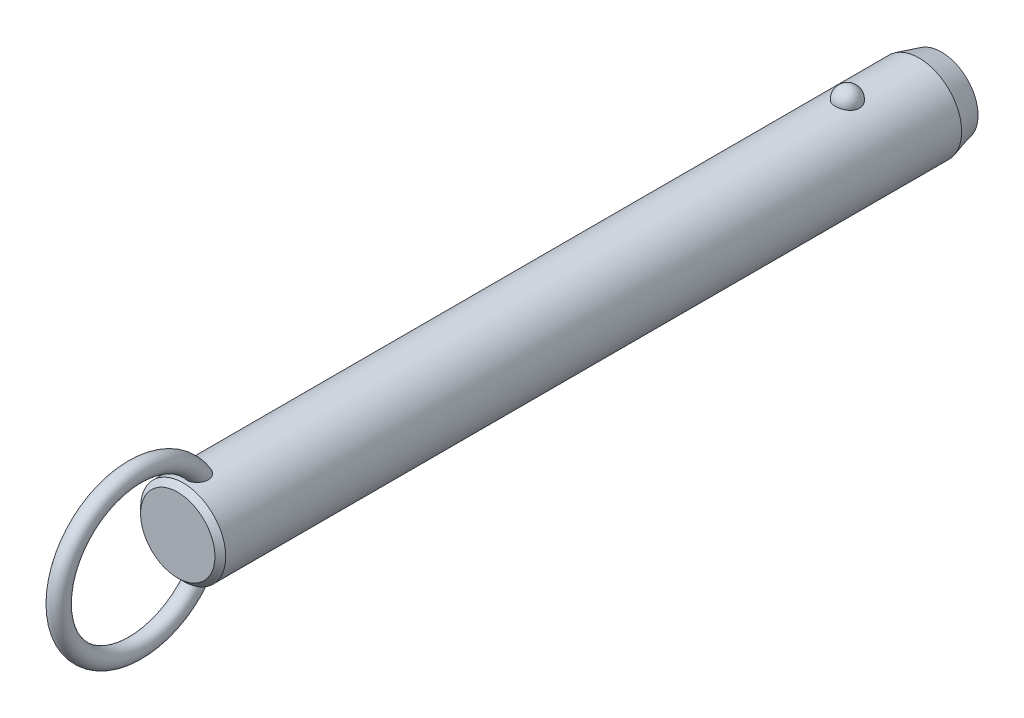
ISO-10303-21;
HEADER;
FILE_DESCRIPTION(('STEP AP214'),'2;1');
FILE_NAME('part.step','',(''),(''),'','','');
FILE_SCHEMA(('AUTOMOTIVE_DESIGN { 1 0 10303 214 1 1 1 1 }'));
ENDSEC;
DATA;
#1=APPLICATION_CONTEXT('core data for automotive mechanical design processes');
#2=APPLICATION_PROTOCOL_DEFINITION('international standard','automotive_design',2000,#1);
#3=PRODUCT_CONTEXT('',#1,'mechanical');
#4=PRODUCT('Part','Part','',(#3));
#5=PRODUCT_RELATED_PRODUCT_CATEGORY('part','',(#4));
#6=PRODUCT_DEFINITION_FORMATION('','',#4);
#7=PRODUCT_DEFINITION_CONTEXT('part definition',#1,'design');
#8=PRODUCT_DEFINITION('design','',#6,#7);
#9=PRODUCT_DEFINITION_SHAPE('','',#8);
#10=(LENGTH_UNIT() NAMED_UNIT(*) SI_UNIT(.MILLI.,.METRE.));
#11=(NAMED_UNIT(*) PLANE_ANGLE_UNIT() SI_UNIT($,.RADIAN.));
#12=(NAMED_UNIT(*) SI_UNIT($,.STERADIAN.) SOLID_ANGLE_UNIT());
#13=UNCERTAINTY_MEASURE_WITH_UNIT(LENGTH_MEASURE(1.E-05),#10,'distance_accuracy_value','');
#14=(GEOMETRIC_REPRESENTATION_CONTEXT(3) GLOBAL_UNCERTAINTY_ASSIGNED_CONTEXT((#13)) GLOBAL_UNIT_ASSIGNED_CONTEXT((#10,
#11,#12)) REPRESENTATION_CONTEXT('',''));
#15=CARTESIAN_POINT('',(0.,0.,0.));
#16=DIRECTION('',(0.,0.,1.));
#17=DIRECTION('',(1.,0.,0.));
#18=AXIS2_PLACEMENT_3D('',#15,#16,#17);
#19=CARTESIAN_POINT('',(0.,0.,137.2));
#20=DIRECTION('',(0.,0.,-1.));
#21=DIRECTION('',(-1.,0.,0.));
#22=AXIS2_PLACEMENT_3D('',#19,#20,#21);
#23=CYLINDRICAL_SURFACE('',#22,9.5);
#24=CARTESIAN_POINT('',(2.67259918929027,9.11631578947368,-2.70000000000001));
#25=CARTESIAN_POINT('',(2.6725968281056,9.11631786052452,-2.54909854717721));
#26=CARTESIAN_POINT('',(2.66030567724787,9.11994722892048,-2.39816735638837));
#27=CARTESIAN_POINT('',(2.6114347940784,9.13405924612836,-2.10058568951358));
#28=CARTESIAN_POINT('',(2.57484658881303,9.14454428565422,-1.95393672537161));
#29=CARTESIAN_POINT('',(2.47830875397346,9.17117631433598,-1.66916069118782));
#30=CARTESIAN_POINT('',(2.41836936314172,9.18732082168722,-1.53102991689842));
#31=CARTESIAN_POINT('',(2.27661331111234,9.22346780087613,-1.26705393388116));
#32=CARTESIAN_POINT('',(2.19479699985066,9.24347021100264,-1.14120852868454));
#33=CARTESIAN_POINT('',(2.01085282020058,9.28522401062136,-0.904632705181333));
#34=CARTESIAN_POINT('',(1.90862396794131,9.30698376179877,-0.793982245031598));
#35=CARTESIAN_POINT('',(1.6867437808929,9.34973971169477,-0.591607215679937));
#36=CARTESIAN_POINT('',(1.56709244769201,9.37073591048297,-0.499882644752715));
#37=CARTESIAN_POINT('',(1.31393976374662,9.40956370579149,-0.338167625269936));
#38=CARTESIAN_POINT('',(1.18048026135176,9.42740444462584,-0.268113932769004));
#39=CARTESIAN_POINT('',(0.903154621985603,9.45799906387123,-0.151390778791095));
#40=CARTESIAN_POINT('',(0.759289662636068,9.47075351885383,-0.104718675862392));
#41=CARTESIAN_POINT('',(0.468074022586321,9.48956256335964,-0.0367633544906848));
#42=CARTESIAN_POINT('',(0.320836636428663,9.49573643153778,-0.0150275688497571));
#43=CARTESIAN_POINT('',(0.0246714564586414,9.50112183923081,0.00396199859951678));
#44=CARTESIAN_POINT('',(-0.124256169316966,9.50033406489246,0.00121819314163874));
#45=CARTESIAN_POINT('',(-0.417264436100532,9.4919475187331,-0.0284441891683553));
#46=CARTESIAN_POINT('',(-0.56138413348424,9.48444885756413,-0.0550074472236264));
#47=CARTESIAN_POINT('',(-0.842986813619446,9.46357853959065,-0.131064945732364));
#48=CARTESIAN_POINT('',(-0.980469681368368,9.450206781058,-0.180559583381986));
#49=CARTESIAN_POINT('',(-1.24585005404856,9.41890822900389,-0.301476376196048));
#50=CARTESIAN_POINT('',(-1.37368611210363,9.40095498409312,-0.373026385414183));
#51=CARTESIAN_POINT('',(-1.61552738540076,9.3624296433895,-0.536025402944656));
#52=CARTESIAN_POINT('',(-1.72953116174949,9.34185727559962,-0.627476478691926));
#53=CARTESIAN_POINT('',(-1.9429225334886,9.29984568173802,-0.829844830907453));
#54=CARTESIAN_POINT('',(-2.04198021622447,9.27839736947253,-0.941108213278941));
#55=CARTESIAN_POINT('',(-2.2202646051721,9.23735994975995,-1.17883414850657));
#56=CARTESIAN_POINT('',(-2.29948985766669,9.21777097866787,-1.30529781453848));
#57=CARTESIAN_POINT('',(-2.43697287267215,9.18238994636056,-1.57158566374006));
#58=CARTESIAN_POINT('',(-2.49497068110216,9.16664569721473,-1.71155057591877));
#59=CARTESIAN_POINT('',(-2.5872073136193,9.14104303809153,-1.99961197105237));
#60=CARTESIAN_POINT('',(-2.62144683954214,9.13118445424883,-2.14770821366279));
#61=CARTESIAN_POINT('',(-2.66521466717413,9.11850622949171,-2.44715424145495));
#62=CARTESIAN_POINT('',(-2.67484831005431,9.11565658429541,-2.59848735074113));
#63=CARTESIAN_POINT('',(-2.66946735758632,9.11723375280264,-2.90067317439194));
#64=CARTESIAN_POINT('',(-2.65445345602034,9.12166036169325,-3.05152590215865));
#65=CARTESIAN_POINT('',(-2.6002971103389,9.13724422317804,-3.34766110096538));
#66=CARTESIAN_POINT('',(-2.56127978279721,9.14836656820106,-3.49296833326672));
#67=CARTESIAN_POINT('',(-2.46018844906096,9.17606676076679,-3.77477535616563));
#68=CARTESIAN_POINT('',(-2.39811349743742,9.19264483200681,-3.9112747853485));
#69=CARTESIAN_POINT('',(-2.25202303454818,9.22952198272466,-4.17244273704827));
#70=CARTESIAN_POINT('',(-2.16788714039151,9.24984129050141,-4.29704106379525));
#71=CARTESIAN_POINT('',(-1.9799408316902,9.29188255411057,-4.53013066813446));
#72=CARTESIAN_POINT('',(-1.87612963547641,9.31360456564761,-4.63862130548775));
#73=CARTESIAN_POINT('',(-1.65105429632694,9.35612959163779,-4.8369029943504));
#74=CARTESIAN_POINT('',(-1.52972405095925,9.37692871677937,-4.92661991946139));
#75=CARTESIAN_POINT('',(-1.27318250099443,9.41518970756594,-5.08429106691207));
#76=CARTESIAN_POINT('',(-1.13797219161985,9.432651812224,-5.15224684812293));
#77=CARTESIAN_POINT('',(-0.859280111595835,9.46208255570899,-5.26371827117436));
#78=CARTESIAN_POINT('',(-0.715925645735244,9.47411833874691,-5.30753421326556));
#79=CARTESIAN_POINT('',(-0.423550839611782,9.4916822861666,-5.37076321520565));
#80=CARTESIAN_POINT('',(-0.2745312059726,9.49721125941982,-5.39017930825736));
#81=CARTESIAN_POINT('',(0.0218446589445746,9.50110860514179,-5.40390587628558));
#82=CARTESIAN_POINT('',(0.16917707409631,9.49961381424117,-5.39869609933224));
#83=CARTESIAN_POINT('',(0.460808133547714,9.48993906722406,-5.36441955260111));
#84=CARTESIAN_POINT('',(0.605106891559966,9.48175936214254,-5.33535367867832));
#85=CARTESIAN_POINT('',(0.886027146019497,9.4596376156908,-5.25435587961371));
#86=CARTESIAN_POINT('',(1.02267710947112,9.44571881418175,-5.20251612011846));
#87=CARTESIAN_POINT('',(1.28523827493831,9.41358993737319,-5.07741549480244));
#88=CARTESIAN_POINT('',(1.41114877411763,9.39537958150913,-5.00415322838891));
#89=CARTESIAN_POINT('',(1.65085227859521,9.3562644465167,-4.83684599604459));
#90=CARTESIAN_POINT('',(1.76442346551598,9.33532178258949,-4.74249218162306));
#91=CARTESIAN_POINT('',(1.97425672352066,9.29321198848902,-4.53620389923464));
#92=CARTESIAN_POINT('',(2.07051582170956,9.27204482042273,-4.42426641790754));
#93=CARTESIAN_POINT('',(2.24490086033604,9.23139221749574,-4.18363183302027));
#94=CARTESIAN_POINT('',(2.32267019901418,9.21194380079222,-4.05466990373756));
#95=CARTESIAN_POINT('',(2.45584092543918,9.1773419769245,-3.78517836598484));
#96=CARTESIAN_POINT('',(2.51124979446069,9.16218713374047,-3.64465264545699));
#97=CARTESIAN_POINT('',(2.59380876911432,9.13913522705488,-3.37104301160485));
#98=CARTESIAN_POINT('',(2.62330266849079,9.13064624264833,-3.23871053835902));
#99=CARTESIAN_POINT('',(2.66269870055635,9.11923566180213,-2.97092664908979));
#100=CARTESIAN_POINT('',(2.67260130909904,9.11631393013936,-2.83547530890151));
#101=CARTESIAN_POINT('',(2.67259918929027,9.11631578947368,-2.70000000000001));
#102=B_SPLINE_CURVE_WITH_KNOTS('',3,(#24,#25,#26,#27,#28,#29,#30,#31,#32,#33,#34,#35,#36,#37,
#38,#39,#40,#41,#42,#43,#44,#45,#46,#47,#48,#49,#50,#51,#52,#53,#54,#55,#56,#57,#58,#59,#60,#61,
#62,#63,#64,#65,#66,#67,#68,#69,#70,#71,#72,#73,#74,#75,#76,#77,#78,#79,#80,#81,#82,#83,#84,#85,
#86,#87,#88,#89,#90,#91,#92,#93,#94,#95,#96,#97,#98,#99,#100,#101),.UNSPECIFIED.,.T.,.F.,(4,2,2,
2,2,2,2,2,2,2,2,2,2,2,2,2,2,2,2,2,2,2,2,2,2,2,2,2,2,2,2,2,2,2,2,2,2,2,4),(0.,0.452217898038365,
0.904593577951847,1.35677112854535,1.80894144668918,2.26340676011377,2.71787203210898,
3.17099820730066,3.62407318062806,4.0687883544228,4.51345969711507,4.95160616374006,
5.38976021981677,5.83050358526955,6.27129275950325,6.72071308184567,7.17016633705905,
7.62495278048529,8.07972578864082,8.53254856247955,8.98535859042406,9.43582813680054,
9.88631615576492,10.3393155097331,10.7923328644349,11.2471065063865,11.7018475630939,
12.150795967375,12.5996885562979,13.0398725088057,13.4800399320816,13.9184421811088,
14.3568730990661,14.802202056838,15.2476074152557,15.7010097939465,16.1542603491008,
16.5602594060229,16.9662486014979),.UNSPECIFIED.);
#103=CARTESIAN_POINT('',(2.67259918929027,9.11631578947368,-2.70000000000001));
#104=VERTEX_POINT('',#103);
#105=EDGE_CURVE('E41',#104,#104,#102,.T.);
#106=ORIENTED_EDGE('',*,*,#105,.T.);
#107=EDGE_LOOP('',(#106));
#108=FACE_BOUND('',#107,.T.);
#109=CARTESIAN_POINT('',(0.,0.,145.52));
#110=DIRECTION('',(0.,0.,1.));
#111=DIRECTION('',(1.,0.,0.));
#112=AXIS2_PLACEMENT_3D('',#109,#110,#111);
#113=CIRCLE('',#112,9.5);
#114=CARTESIAN_POINT('',(9.5,0.,145.52));
#115=VERTEX_POINT('',#114);
#116=EDGE_CURVE('E10',#115,#115,#113,.F.);
#117=ORIENTED_EDGE('',*,*,#116,.T.);
#118=EDGE_LOOP('',(#117));
#119=FACE_BOUND('',#118,.T.);
#120=CARTESIAN_POINT('',(-0.697062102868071,-9.47439269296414,139.867808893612));
#121=CARTESIAN_POINT('',(-0.799579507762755,-9.46685146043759,139.907482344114));
#122=CARTESIAN_POINT('',(-0.898575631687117,-9.45788043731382,139.9559309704));
#123=CARTESIAN_POINT('',(-1.08670047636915,-9.43811593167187,140.068868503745));
#124=CARTESIAN_POINT('',(-1.17583204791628,-9.42732297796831,140.133352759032));
#125=CARTESIAN_POINT('',(-1.34179806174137,-9.40513672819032,140.276209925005));
#126=CARTESIAN_POINT('',(-1.41865133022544,-9.39374438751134,140.354561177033));
#127=CARTESIAN_POINT('',(-1.55860047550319,-9.37154196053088,140.522752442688));
#128=CARTESIAN_POINT('',(-1.62169476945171,-9.3607319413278,140.61259377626));
#129=CARTESIAN_POINT('',(-1.73527695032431,-9.34035749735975,140.804500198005));
#130=CARTESIAN_POINT('',(-1.78522266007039,-9.33085270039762,140.906891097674));
#131=CARTESIAN_POINT('',(-1.86924997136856,-9.3143834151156,141.118148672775));
#132=CARTESIAN_POINT('',(-1.90332570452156,-9.30741986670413,141.227017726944));
#133=CARTESIAN_POINT('',(-1.95893603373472,-9.29588482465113,141.460473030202));
#134=CARTESIAN_POINT('',(-1.97872420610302,-9.29165182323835,141.585489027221));
#135=CARTESIAN_POINT('',(-2.00062129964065,-9.28695978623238,141.837080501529));
#136=CARTESIAN_POINT('',(-2.00272284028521,-9.28650232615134,141.963656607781));
#137=CARTESIAN_POINT('',(-1.98958876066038,-9.28932750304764,142.236815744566));
#138=CARTESIAN_POINT('',(-1.97143366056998,-9.2932400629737,142.383251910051));
#139=CARTESIAN_POINT('',(-1.91479925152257,-9.30507151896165,142.672062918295));
#140=CARTESIAN_POINT('',(-1.87629122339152,-9.31299607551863,142.814431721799));
#141=CARTESIAN_POINT('',(-1.77225683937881,-9.33340232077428,143.115172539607));
#142=CARTESIAN_POINT('',(-1.70334898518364,-9.34641636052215,143.272369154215));
#143=CARTESIAN_POINT('',(-1.58111062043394,-9.36759153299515,143.497517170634));
#144=CARTESIAN_POINT('',(-1.53721459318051,-9.37492619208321,143.570796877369));
#145=CARTESIAN_POINT('',(-1.4430263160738,-9.38988566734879,143.71307405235));
#146=CARTESIAN_POINT('',(-1.39273721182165,-9.39751033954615,143.782073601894));
#147=CARTESIAN_POINT('',(-1.26775962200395,-9.41530678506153,143.936983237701));
#148=CARTESIAN_POINT('',(-1.19052326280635,-9.42548108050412,144.020871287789));
#149=CARTESIAN_POINT('',(-1.02420241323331,-9.44499825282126,144.176008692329));
#150=CARTESIAN_POINT('',(-0.93513986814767,-9.45434261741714,144.247280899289));
#151=CARTESIAN_POINT('',(-0.766610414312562,-9.46930670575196,144.358695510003));
#152=CARTESIAN_POINT('',(-0.689439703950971,-9.47529223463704,144.402235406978));
#153=CARTESIAN_POINT('',(-0.528942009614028,-9.48560294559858,144.47631336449));
#154=CARTESIAN_POINT('',(-0.445620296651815,-9.48992953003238,144.506862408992));
#155=CARTESIAN_POINT('',(-0.273901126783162,-9.49644161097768,144.552579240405));
#156=CARTESIAN_POINT('',(-0.18546574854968,-9.49860811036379,144.56761059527));
#157=CARTESIAN_POINT('',(-0.00734541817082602,-9.5004135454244,144.580149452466));
#158=CARTESIAN_POINT('',(0.0823387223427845,-9.50005405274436,144.577667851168));
#159=CARTESIAN_POINT('',(0.24767927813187,-9.49708301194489,144.556995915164));
#160=CARTESIAN_POINT('',(0.323620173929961,-9.49477609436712,144.540930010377));
#161=CARTESIAN_POINT('',(0.471981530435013,-9.48855917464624,144.497172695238));
#162=CARTESIAN_POINT('',(0.544400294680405,-9.48464840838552,144.469475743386));
#163=CARTESIAN_POINT('',(0.708947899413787,-9.47398336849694,144.39280266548));
#164=CARTESIAN_POINT('',(0.799149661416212,-9.46671310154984,144.339774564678));
#165=CARTESIAN_POINT('',(0.969783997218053,-9.45076225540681,144.219973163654));
#166=CARTESIAN_POINT('',(1.050194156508,-9.44207854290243,144.153169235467));
#167=CARTESIAN_POINT('',(1.23092343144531,-9.42051459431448,143.980759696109));
#168=CARTESIAN_POINT('',(1.32652499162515,-9.40733378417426,143.87026193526));
#169=CARTESIAN_POINT('',(1.49893121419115,-9.38140745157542,143.635561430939));
#170=CARTESIAN_POINT('',(1.5757161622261,-9.36866239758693,143.511344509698));
#171=CARTESIAN_POINT('',(1.71285426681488,-9.34457644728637,143.249389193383));
#172=CARTESIAN_POINT('',(1.77266365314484,-9.33328726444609,143.11136233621));
#173=CARTESIAN_POINT('',(1.87239208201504,-9.31379209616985,142.828051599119));
#174=CARTESIAN_POINT('',(1.91230158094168,-9.3055875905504,142.682764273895));
#175=CARTESIAN_POINT('',(1.97604189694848,-9.29228394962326,142.362028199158));
#176=CARTESIAN_POINT('',(1.9958743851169,-9.28797202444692,142.185724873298));
#177=CARTESIAN_POINT('',(2.0029570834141,-9.28645519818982,141.832414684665));
#178=CARTESIAN_POINT('',(1.99025930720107,-9.28923895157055,141.655409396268));
#179=CARTESIAN_POINT('',(1.93735479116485,-9.30038134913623,141.356338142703));
#180=CARTESIAN_POINT('',(1.90576827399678,-9.30697680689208,141.232667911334));
#181=CARTESIAN_POINT('',(1.8228748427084,-9.32356855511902,140.992329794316));
#182=CARTESIAN_POINT('',(1.77158213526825,-9.33356239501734,140.875656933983));
#183=CARTESIAN_POINT('',(1.64885744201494,-9.35602275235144,140.652706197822));
#184=CARTESIAN_POINT('',(1.57730995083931,-9.36850332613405,140.546492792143));
#185=CARTESIAN_POINT('',(1.41543264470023,-9.39431873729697,140.349553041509));
#186=CARTESIAN_POINT('',(1.32510883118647,-9.40765330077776,140.258821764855));
#187=CARTESIAN_POINT('',(1.13846223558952,-9.43195720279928,140.105033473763));
#188=CARTESIAN_POINT('',(1.04369890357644,-9.44302894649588,140.040094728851));
#189=CARTESIAN_POINT('',(0.843965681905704,-9.46296805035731,139.928038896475));
#190=CARTESIAN_POINT('',(0.739000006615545,-9.47183631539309,139.880914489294));
#191=CARTESIAN_POINT('',(0.528175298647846,-9.48586140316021,139.808117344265));
#192=CARTESIAN_POINT('',(0.422686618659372,-9.49119633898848,139.78140249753));
#193=CARTESIAN_POINT('',(0.208590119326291,-9.49831365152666,139.746013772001));
#194=CARTESIAN_POINT('',(0.0999817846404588,-9.500095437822,139.737342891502));
#195=CARTESIAN_POINT('',(-0.126104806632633,-9.49988861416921,139.738350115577));
#196=CARTESIAN_POINT('',(-0.243578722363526,-9.49757821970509,139.749594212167));
#197=CARTESIAN_POINT('',(-0.474390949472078,-9.48885165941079,139.793167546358));
#198=CARTESIAN_POINT('',(-0.587729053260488,-9.48243528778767,139.825497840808));
#199=CARTESIAN_POINT('',(-0.697062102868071,-9.47439269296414,139.867808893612));
#200=B_SPLINE_CURVE_WITH_KNOTS('',3,(#120,#121,#122,#123,#124,#125,#126,#127,#128,#129,#130,
#131,#132,#133,#134,#135,#136,#137,#138,#139,#140,#141,#142,#143,#144,#145,#146,#147,#148,#149,
#150,#151,#152,#153,#154,#155,#156,#157,#158,#159,#160,#161,#162,#163,#164,#165,#166,#167,#168,
#169,#170,#171,#172,#173,#174,#175,#176,#177,#178,#179,#180,#181,#182,#183,#184,#185,#186,#187,
#188,#189,#190,#191,#192,#193,#194,#195,#196,#197,#198,#199),.UNSPECIFIED.,.T.,.F.,(4,2,2,2,2,2,
2,2,2,2,2,2,2,2,2,2,2,2,2,2,2,2,2,2,2,2,2,2,2,2,2,2,2,2,2,2,2,2,2,4),(0.,0.330119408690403,
0.660143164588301,0.989655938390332,1.31920659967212,1.66074728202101,2.00241415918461,
2.38088696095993,2.75951768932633,3.20065679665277,3.64242004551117,4.15620996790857,
4.4131416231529,4.66994734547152,5.01228664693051,5.35399933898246,5.61943037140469,
5.88463652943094,6.15215502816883,6.4195070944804,6.65144391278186,6.88349136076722,
7.19641200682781,7.51003602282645,7.94779711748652,8.3860149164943,8.83699707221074,
9.28819530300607,9.81778662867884,10.34653170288,10.7284172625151,11.1100280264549,
11.4938603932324,11.8775702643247,12.2220189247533,12.5663259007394,12.8915939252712,
13.2169159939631,13.5689650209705,13.9210316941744),.UNSPECIFIED.);
#201=CARTESIAN_POINT('',(-0.697062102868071,-9.47439269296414,139.867808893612));
#202=VERTEX_POINT('',#201);
#203=EDGE_CURVE('E59',#202,#202,#200,.T.);
#204=ORIENTED_EDGE('',*,*,#203,.T.);
#205=EDGE_LOOP('',(#204));
#206=FACE_BOUND('',#205,.T.);
#207=CARTESIAN_POINT('',(-0.697062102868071,9.47439269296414,139.867808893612));
#208=CARTESIAN_POINT('',(-0.597792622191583,9.48169483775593,139.829395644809));
#209=CARTESIAN_POINT('',(-0.495106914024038,9.48766580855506,139.799168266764));
#210=CARTESIAN_POINT('',(-0.285876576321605,9.49627648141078,139.756032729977));
#211=CARTESIAN_POINT('',(-0.179324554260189,9.49890941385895,139.743159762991));
#212=CARTESIAN_POINT('',(0.0344157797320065,9.50053798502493,139.735166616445));
#213=CARTESIAN_POINT('',(0.141603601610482,9.49953613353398,139.740034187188));
#214=CARTESIAN_POINT('',(0.35356357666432,9.49401038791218,139.767365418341));
#215=CARTESIAN_POINT('',(0.458336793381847,9.48948807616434,139.78982117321));
#216=CARTESIAN_POINT('',(0.662493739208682,9.4774236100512,139.851671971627));
#217=CARTESIAN_POINT('',(0.761881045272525,9.46988348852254,139.891055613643));
#218=CARTESIAN_POINT('',(0.952608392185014,9.45260382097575,139.985634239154));
#219=CARTESIAN_POINT('',(1.04394806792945,9.44286417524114,140.040829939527));
#220=CARTESIAN_POINT('',(1.21712767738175,9.42211760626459,140.166066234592));
#221=CARTESIAN_POINT('',(1.29885671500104,9.41109835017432,140.236257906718));
#222=CARTESIAN_POINT('',(1.44978975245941,9.38903310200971,140.388980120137));
#223=CARTESIAN_POINT('',(1.51899278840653,9.37798710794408,140.471511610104));
#224=CARTESIAN_POINT('',(1.64602857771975,9.35654375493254,140.649776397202));
#225=CARTESIAN_POINT('',(1.70333052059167,9.34618688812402,140.745891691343));
#226=CARTESIAN_POINT('',(1.80259341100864,9.32755128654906,140.945897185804));
#227=CARTESIAN_POINT('',(1.84454942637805,9.31927322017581,141.049789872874));
#228=CARTESIAN_POINT('',(1.91637039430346,9.30478365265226,141.272213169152));
#229=CARTESIAN_POINT('',(1.944805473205,9.29882552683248,141.391219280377));
#230=CARTESIAN_POINT('',(1.98449865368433,9.29043398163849,141.632143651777));
#231=CARTESIAN_POINT('',(1.99574908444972,9.28800213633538,141.754063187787));
#232=CARTESIAN_POINT('',(2.00275141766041,9.28649645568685,142.016932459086));
#233=CARTESIAN_POINT('',(1.99588238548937,9.28799035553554,142.157952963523));
#234=CARTESIAN_POINT('',(1.96270559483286,9.29505517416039,142.437621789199));
#235=CARTESIAN_POINT('',(1.93637872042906,9.30063010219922,142.576267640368));
#236=CARTESIAN_POINT('',(1.85949176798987,9.31633564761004,142.872561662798));
#237=CARTESIAN_POINT('',(1.80549792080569,9.3270926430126,143.029290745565));
#238=CARTESIAN_POINT('',(1.67376869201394,9.3516306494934,143.332284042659));
#239=CARTESIAN_POINT('',(1.59603181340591,9.36541185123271,143.478547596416));
#240=CARTESIAN_POINT('',(1.4360277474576,9.39110706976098,143.725813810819));
#241=CARTESIAN_POINT('',(1.35831795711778,9.40278656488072,143.829791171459));
#242=CARTESIAN_POINT('',(1.18774483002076,9.42585025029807,144.024534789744));
#243=CARTESIAN_POINT('',(1.09490932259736,9.43723493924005,144.115324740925));
#244=CARTESIAN_POINT('',(0.92111037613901,9.45552616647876,144.25620334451));
#245=CARTESIAN_POINT('',(0.84373824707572,9.46281058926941,144.310656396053));
#246=CARTESIAN_POINT('',(0.681245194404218,9.47589120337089,144.406711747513));
#247=CARTESIAN_POINT('',(0.596135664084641,9.48168953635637,144.448332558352));
#248=CARTESIAN_POINT('',(0.433779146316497,9.49038144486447,144.510089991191));
#249=CARTESIAN_POINT('',(0.357459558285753,9.49359170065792,144.53260136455));
#250=CARTESIAN_POINT('',(0.202074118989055,9.49816761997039,144.564574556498));
#251=CARTESIAN_POINT('',(0.123010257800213,9.49953459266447,144.574045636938));
#252=CARTESIAN_POINT('',(-0.0357372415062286,9.50026497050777,144.579114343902));
#253=CARTESIAN_POINT('',(-0.115421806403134,9.49962433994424,144.574684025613));
#254=CARTESIAN_POINT('',(-0.272823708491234,9.49640854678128,144.552296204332));
#255=CARTESIAN_POINT('',(-0.350540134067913,9.4938325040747,144.534332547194));
#256=CARTESIAN_POINT('',(-0.500580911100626,9.48709462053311,144.486802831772));
#257=CARTESIAN_POINT('',(-0.572979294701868,9.48296359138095,144.457461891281));
#258=CARTESIAN_POINT('',(-0.712864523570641,9.47347609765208,144.389008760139));
#259=CARTESIAN_POINT('',(-0.780349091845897,9.46811906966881,144.349892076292));
#260=CARTESIAN_POINT('',(-0.946309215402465,9.45329720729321,144.239432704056));
#261=CARTESIAN_POINT('',(-1.04090230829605,9.44321512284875,144.162329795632));
#262=CARTESIAN_POINT('',(-1.21661929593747,9.42219227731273,143.99409718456));
#263=CARTESIAN_POINT('',(-1.29770519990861,9.41124921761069,143.902929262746));
#264=CARTESIAN_POINT('',(-1.47319646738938,9.38563439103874,143.676162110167));
#265=CARTESIAN_POINT('',(-1.56208878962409,9.37102009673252,143.536289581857));
#266=CARTESIAN_POINT('',(-1.71623987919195,9.34401559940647,143.243950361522));
#267=CARTESIAN_POINT('',(-1.78147866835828,9.33162728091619,143.091473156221));
#268=CARTESIAN_POINT('',(-1.88853837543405,9.31055541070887,142.775647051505));
#269=CARTESIAN_POINT('',(-1.92998995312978,9.30193076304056,142.612168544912));
#270=CARTESIAN_POINT('',(-1.98590726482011,9.29015757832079,142.280526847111));
#271=CARTESIAN_POINT('',(-2.0004070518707,9.2870021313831,142.112369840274));
#272=CARTESIAN_POINT('',(-1.99964701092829,9.28716218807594,141.805080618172));
#273=CARTESIAN_POINT('',(-1.98908145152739,9.28945704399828,141.665936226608));
#274=CARTESIAN_POINT('',(-1.94566294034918,9.29865169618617,141.391153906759));
#275=CARTESIAN_POINT('',(-1.9128206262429,9.30554929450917,141.255514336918));
#276=CARTESIAN_POINT('',(-1.84582133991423,9.31898248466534,141.057802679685));
#277=CARTESIAN_POINT('',(-1.82038084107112,9.32400364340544,140.992583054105));
#278=CARTESIAN_POINT('',(-1.76350511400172,9.33492884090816,140.864903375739));
#279=CARTESIAN_POINT('',(-1.73207305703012,9.34083241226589,140.802441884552));
#280=CARTESIAN_POINT('',(-1.66324243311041,9.35333332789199,140.68094078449));
#281=CARTESIAN_POINT('',(-1.62584239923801,9.35993084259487,140.621902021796));
#282=CARTESIAN_POINT('',(-1.54527678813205,9.37356864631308,140.507987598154));
#283=CARTESIAN_POINT('',(-1.50211241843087,9.38060884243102,140.453111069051));
#284=CARTESIAN_POINT('',(-1.37681147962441,9.40004442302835,140.309961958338));
#285=CARTESIAN_POINT('',(-1.28916358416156,9.41261047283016,140.226429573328));
#286=CARTESIAN_POINT('',(-1.09996826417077,9.43658180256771,140.077236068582));
#287=CARTESIAN_POINT('',(-0.998461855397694,9.44799034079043,140.011523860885));
#288=CARTESIAN_POINT('',(-0.860188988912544,9.46103017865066,139.9394367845));
#289=CARTESIAN_POINT('',(-0.828141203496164,9.46389141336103,139.923851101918));
#290=CARTESIAN_POINT('',(-0.763210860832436,9.46934915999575,139.894473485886));
#291=CARTESIAN_POINT('',(-0.730328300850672,9.47194567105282,139.880681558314));
#292=CARTESIAN_POINT('',(-0.697062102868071,9.47439269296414,139.867808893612));
#293=B_SPLINE_CURVE_WITH_KNOTS('',3,(#207,#208,#209,#210,#211,#212,#213,#214,#215,#216,#217,
#218,#219,#220,#221,#222,#223,#224,#225,#226,#227,#228,#229,#230,#231,#232,#233,#234,#235,#236,
#237,#238,#239,#240,#241,#242,#243,#244,#245,#246,#247,#248,#249,#250,#251,#252,#253,#254,#255,
#256,#257,#258,#259,#260,#261,#262,#263,#264,#265,#266,#267,#268,#269,#270,#271,#272,#273,#274,
#275,#276,#277,#278,#279,#280,#281,#282,#283,#284,#285,#286,#287,#288,#289,#290,#291,#292),
.UNSPECIFIED.,.T.,.F.,(4,2,2,2,2,2,2,2,2,2,2,2,2,2,2,2,2,2,2,2,2,2,2,2,2,2,2,2,2,2,2,2,2,2,2,2,
2,2,2,2,2,2,4),(0.,0.319942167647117,0.640532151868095,0.96090081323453,1.2811255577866,
1.60113495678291,1.92115886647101,2.24457323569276,2.56801248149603,2.90371927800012,
3.23953387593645,3.60560313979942,3.97183576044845,4.39383693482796,4.8162532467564,
5.31257045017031,5.80891895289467,6.19868344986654,6.58773876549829,6.87145417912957,
7.15475838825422,7.39263751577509,7.63034760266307,7.86853584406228,8.10683246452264,
8.3406366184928,8.57454843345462,8.93983939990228,9.30614105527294,9.80266668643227,
10.2996107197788,10.8040753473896,11.3079021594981,11.7249776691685,12.1418541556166,
12.3521485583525,12.5623319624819,12.7725671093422,12.9827582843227,13.345827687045,
13.7078449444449,13.8150604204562,13.9222762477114),.UNSPECIFIED.);
#294=CARTESIAN_POINT('',(-0.697062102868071,9.47439269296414,139.867808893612));
#295=VERTEX_POINT('',#294);
#296=EDGE_CURVE('E67',#295,#295,#293,.T.);
#297=ORIENTED_EDGE('',*,*,#296,.T.);
#298=EDGE_LOOP('',(#297));
#299=FACE_BOUND('',#298,.T.);
#300=CARTESIAN_POINT('',(0.,0.,-18.6999999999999));
#301=DIRECTION('',(0.,0.,-1.));
#302=DIRECTION('',(-1.,0.,0.));
#303=AXIS2_PLACEMENT_3D('',#300,#301,#302);
#304=CIRCLE('',#303,9.5);
#305=CARTESIAN_POINT('',(-9.5,0.,-18.6999999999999));
#306=VERTEX_POINT('',#305);
#307=EDGE_CURVE('E56',#306,#306,#304,.F.);
#308=ORIENTED_EDGE('',*,*,#307,.T.);
#309=EDGE_LOOP('',(#308));
#310=FACE_BOUND('',#309,.T.);
#311=ADVANCED_FACE('F37',(#108,#119,#206,#299,#310),#23,.T.);
#312=CARTESIAN_POINT('',(0.,0.,-23.7));
#313=DIRECTION('',(0.,0.,-1.));
#314=DIRECTION('',(-1.,0.,0.));
#315=AXIS2_PLACEMENT_3D('',#312,#313,#314);
#316=PLANE('',#315);
#317=CARTESIAN_POINT('',(0.,0.,-23.7));
#318=DIRECTION('',(0.,0.,-1.));
#319=DIRECTION('',(-1.,0.,0.));
#320=AXIS2_PLACEMENT_3D('',#317,#318,#319);
#321=CIRCLE('',#320,8.16025403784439);
#322=CARTESIAN_POINT('',(-8.16025403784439,0.,-23.7));
#323=VERTEX_POINT('',#322);
#324=EDGE_CURVE('E66',#323,#323,#321,.T.);
#325=ORIENTED_EDGE('',*,*,#324,.T.);
#326=EDGE_LOOP('',(#325));
#327=FACE_BOUND('',#326,.T.);
#328=ADVANCED_FACE('F85',(#327),#316,.T.);
#329=CARTESIAN_POINT('',(0.,0.,-23.7));
#330=DIRECTION('',(0.,0.,1.));
#331=DIRECTION('',(1.,0.,0.));
#332=AXIS2_PLACEMENT_3D('',#329,#330,#331);
#333=CONICAL_SURFACE('',#332,8.16025403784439,0.261799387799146);
#334=ORIENTED_EDGE('',*,*,#307,.F.);
#335=EDGE_LOOP('',(#334));
#336=FACE_BOUND('',#335,.T.);
#337=ORIENTED_EDGE('',*,*,#324,.F.);
#338=EDGE_LOOP('',(#337));
#339=FACE_BOUND('',#338,.T.);
#340=ADVANCED_FACE('F83',(#336,#339),#333,.T.);
#341=CARTESIAN_POINT('',(0.,0.,146.72));
#342=DIRECTION('',(0.,0.,1.));
#343=DIRECTION('',(1.,0.,0.));
#344=AXIS2_PLACEMENT_3D('',#341,#342,#343);
#345=PLANE('',#344);
#346=CARTESIAN_POINT('',(0.,0.,146.72));
#347=DIRECTION('',(0.,0.,1.));
#348=DIRECTION('',(1.,0.,0.));
#349=AXIS2_PLACEMENT_3D('',#346,#347,#348);
#350=CIRCLE('',#349,8.30000000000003);
#351=CARTESIAN_POINT('',(8.30000000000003,0.,146.72));
#352=VERTEX_POINT('',#351);
#353=EDGE_CURVE('E50',#352,#352,#350,.T.);
#354=ORIENTED_EDGE('',*,*,#353,.T.);
#355=EDGE_LOOP('',(#354));
#356=FACE_BOUND('',#355,.T.);
#357=ADVANCED_FACE('F77',(#356),#345,.T.);
#358=CARTESIAN_POINT('',(0.,0.,156.25));
#359=DIRECTION('',(1.,0.,0.));
#360=DIRECTION('',(0.,0.,-1.));
#361=AXIS2_PLACEMENT_3D('',#358,#359,#360);
#362=TOROIDAL_SURFACE('',#361,17.05,2.);
#363=ORIENTED_EDGE('',*,*,#296,.F.);
#364=EDGE_LOOP('',(#363));
#365=FACE_BOUND('',#364,.T.);
#366=ORIENTED_EDGE('',*,*,#203,.F.);
#367=EDGE_LOOP('',(#366));
#368=FACE_BOUND('',#367,.T.);
#369=ADVANCED_FACE('F73',(#365,#368),#362,.T.);
#370=CARTESIAN_POINT('',(0.,0.,146.72));
#371=DIRECTION('',(0.,0.,-1.));
#372=DIRECTION('',(-1.,0.,0.));
#373=AXIS2_PLACEMENT_3D('',#370,#371,#372);
#374=CONICAL_SURFACE('',#373,8.30000000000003,0.785398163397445);
#375=ORIENTED_EDGE('',*,*,#116,.F.);
#376=EDGE_LOOP('',(#375));
#377=FACE_BOUND('',#376,.T.);
#378=ORIENTED_EDGE('',*,*,#353,.F.);
#379=EDGE_LOOP('',(#378));
#380=FACE_BOUND('',#379,.T.);
#381=ADVANCED_FACE('F39',(#377,#380),#374,.T.);
#382=CARTESIAN_POINT('',(0.,9.5,-2.70000000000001));
#383=DIRECTION('',(0.,1.,0.));
#384=DIRECTION('',(0.,0.,-1.));
#385=AXIS2_PLACEMENT_3D('',#382,#383,#384);
#386=SPHERICAL_SURFACE('',#385,2.7);
#387=ORIENTED_EDGE('',*,*,#105,.F.);
#388=EDGE_LOOP('',(#387));
#389=FACE_BOUND('',#388,.T.);
#390=ADVANCED_FACE('F79',(#389),#386,.T.);
#391=CLOSED_SHELL('',(#311,#328,#340,#357,#369,#381,#390));
#392=MANIFOLD_SOLID_BREP('B2',#391);
#393=ADVANCED_BREP_SHAPE_REPRESENTATION('',(#18,#392),#14);
#394=SHAPE_DEFINITION_REPRESENTATION(#9,#393);
ENDSEC;
END-ISO-10303-21;
